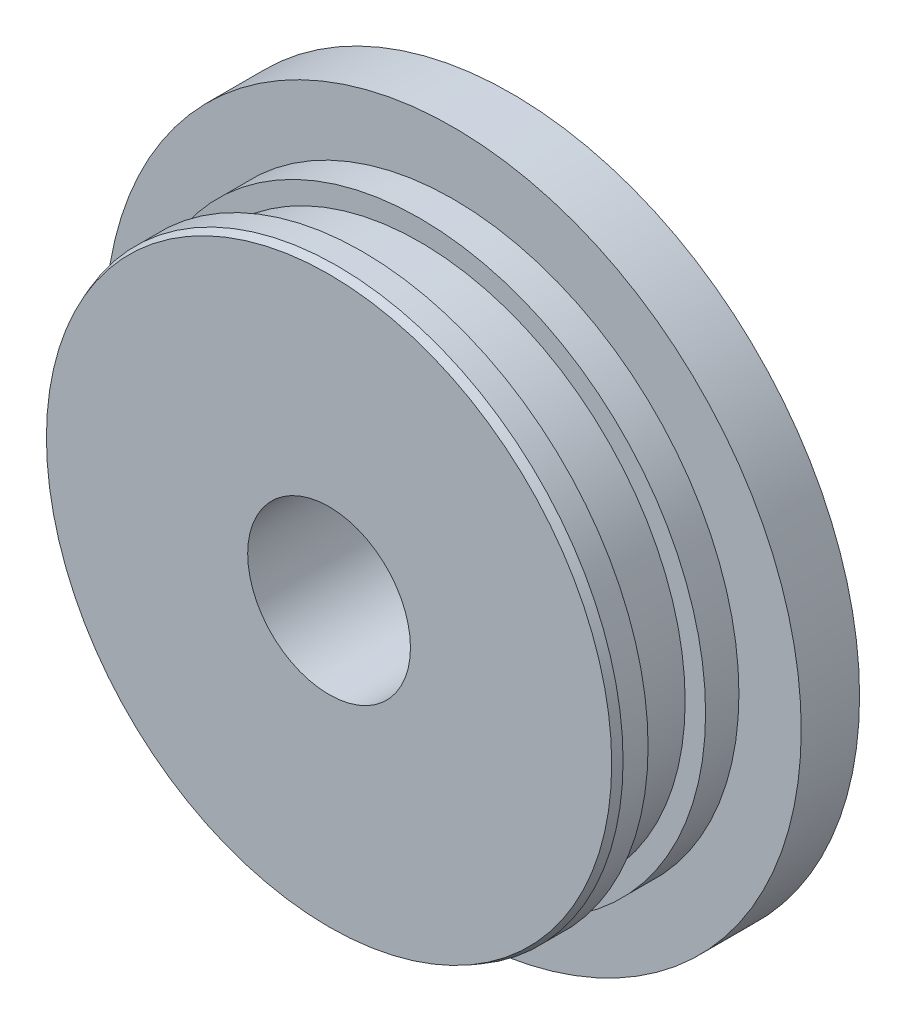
from build123d import *

# Parameters (mm, degrees)
SKETCH1_R              = 21.209
ORTMAN_PLUG_DEPTH      = 1.27
SKETCH2_R              = 21.209
ORTMAN_GROOVE_DEPTH    = 1.27
SKETCH3_R              = 21.209
ORTMAN_PLUG2_DEPTH     = 1.016
SKETCH4_R              = 17.4117
ORING_BOSS_DEPTH       = 2.032
SKETCH5_R              = 16.1671
ORING_GROOVE_DEPTH     = 3.5052
SKETCH6_R              = 17.4117
ORING_BOSS2_DEPTH      = 2.032
CHAMFER2_SIZE          = 0.508
CHAMFER2_SIZE2         = 0.184896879
SKETCH21_R             = 4.96062
THRU_HOLE_DEPTH        = 25.4
SKETCH31_R             = 10.5156
LAND_DEPTH             = 0.0508
SKETCH41_R             = 6.1849
F_12_DEG_CHAMFER_DEPTH = 2.3622
F_12_DEG_CHAMFER_DRAFT = -12
SKETCH51_R             = 5.68279889
F_45_DEG_CHAMFER_DEPTH = 2.54
F_45_DEG_CHAMFER_DRAFT = -45


with BuildPart() as part:
    # Sketch1 → ortman_plug (new body)
    with BuildSketch(Plane.XY):
        Circle(SKETCH1_R)
    extrude(amount=ORTMAN_PLUG_DEPTH)

    # Sketch2 → ortman_groove (add)
    with BuildSketch(Plane.XY.offset(1.27)):
        Circle(SKETCH2_R)
    extrude(amount=ORTMAN_GROOVE_DEPTH)

    # Sketch3 → ortman_plug2 (add)
    with BuildSketch(Plane.XY.offset(2.54)):
        Circle(SKETCH3_R)
    extrude(amount=ORTMAN_PLUG2_DEPTH)

    # Sketch4 → oring_boss (add)
    with BuildSketch(Plane.XY.offset(3.556)):
        Circle(SKETCH4_R)
    extrude(amount=ORING_BOSS_DEPTH)

    # Sketch5 → oring_groove (add)
    with BuildSketch(Plane.XY.offset(5.588)):
        Circle(SKETCH5_R)
    extrude(amount=ORING_GROOVE_DEPTH)

    # Sketch6 → oring_boss2 (add)
    with BuildSketch(Plane.XY.offset(9.0932)):
        Circle(SKETCH6_R)
    extrude(amount=ORING_BOSS2_DEPTH)

    # Chamfer2
    chamfer2_edges = [part.edges().sort_by_distance(p)[0] for p in [
        (-17.4117, 0, 11.1252),
    ]]
    chamfer2_side = [part.faces().sort_by_distance(p)[0] for p in [
        (-17.4117, 0, 10.1092),
    ]]
    chamfer(chamfer2_edges, length=CHAMFER2_SIZE, length2=CHAMFER2_SIZE2, reference=chamfer2_side[0])

    # Sketch21 → thru_hole (cut)
    with BuildSketch(Plane(origin=(8.815671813, 8.047090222, 0), x_dir=(-1, 0, 0), z_dir=(0, 0, -1))):
        with Locations((8.815671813, -8.047090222)):
            Circle(SKETCH21_R)
    extrude(amount=-THRU_HOLE_DEPTH, mode=Mode.SUBTRACT)

    # Sketch31 → land (cut)
    with BuildSketch(Plane(origin=(0, 0, 0), x_dir=(-1, 0, 0), z_dir=(0, 0, -1))):
        Circle(SKETCH31_R)
    extrude(amount=-LAND_DEPTH, mode=Mode.SUBTRACT)


with BuildPart() as f_12_deg_chamfer_tool:
    # Sketch41 → 12_deg_chamfer (with draft: the straight prism first)
    with BuildSketch(Plane(origin=(0, 0, 0.0508), x_dir=(-1, 0, 0), z_dir=(0, 0, -1))):
        Circle(SKETCH41_R)
    extrude(amount=-F_12_DEG_CHAMFER_DEPTH)
    # 12_deg_chamfer: the draft: its side faces are tilted about the plane it starts from
    f_12_deg_chamfer_sides = [f_12_deg_chamfer_tool.faces().sort_by_distance(p)[0] for p in [
        (6.1849, 0, 1.2319),
    ]]
    draft(f_12_deg_chamfer_sides, Plane(origin=(0, 0, 0.0508), x_dir=(-1, 0, 0), z_dir=(0, 0, -1)), F_12_DEG_CHAMFER_DRAFT)


with BuildPart() as part_1:
    add(part.part)

    # 12_deg_chamfer: cut by f_12_deg_chamfer_tool
    add(f_12_deg_chamfer_tool.part, mode=Mode.SUBTRACT)


with BuildPart() as f_45_deg_chamfer_tool:
    # Sketch51 → 45_deg_chamfer (with draft: the straight prism first)
    with BuildSketch(Plane(origin=(0, 0, 2.413), x_dir=(-1, 0, 0), z_dir=(0, 0, -1))):
        Circle(SKETCH51_R)
    extrude(amount=-F_45_DEG_CHAMFER_DEPTH)
    # 45_deg_chamfer: the draft: its side faces are tilted about the plane it starts from
    f_45_deg_chamfer_sides = [f_45_deg_chamfer_tool.faces().sort_by_distance(p)[0] for p in [
        (5.68279889, 0, 3.683),
    ]]
    draft(f_45_deg_chamfer_sides, Plane(origin=(0, 0, 2.413), x_dir=(-1, 0, 0), z_dir=(0, 0, -1)), F_45_DEG_CHAMFER_DRAFT)


with BuildPart() as part_2:
    add(part_1.part)

    # 45_deg_chamfer: cut by f_45_deg_chamfer_tool
    add(f_45_deg_chamfer_tool.part, mode=Mode.SUBTRACT)


solid = part_2.part
